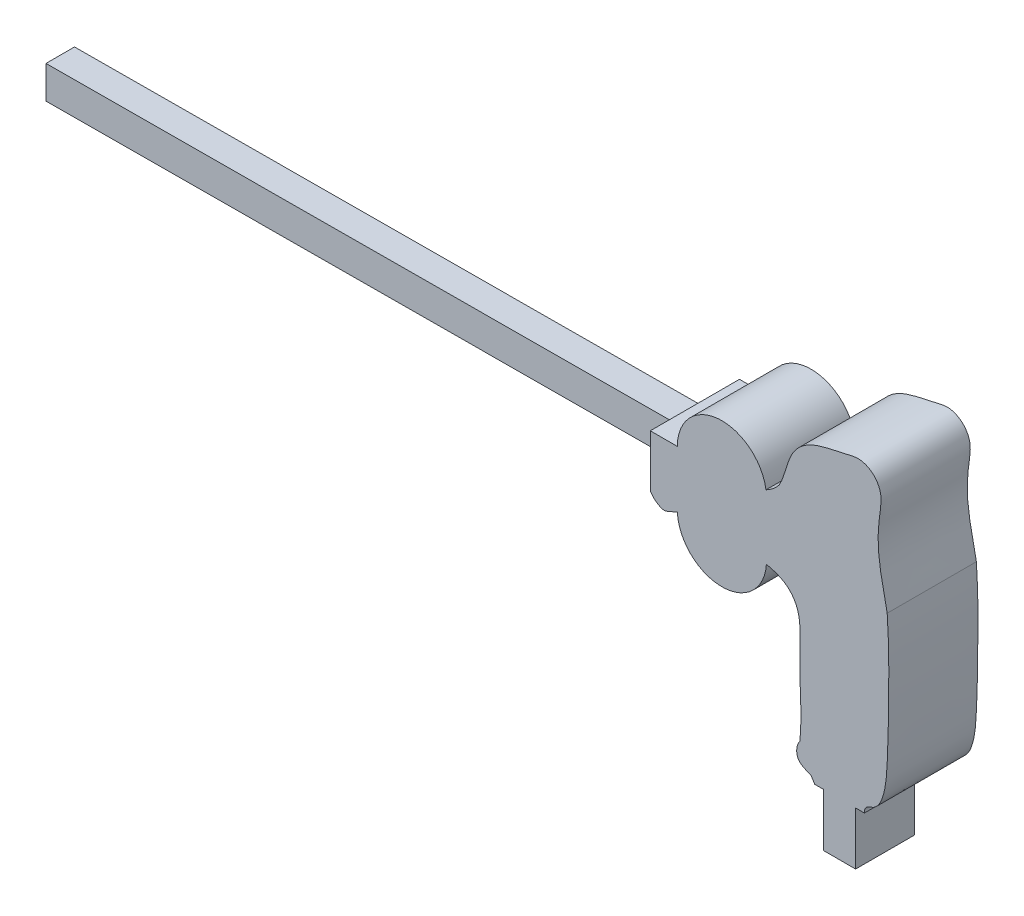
ISO-10303-21;
HEADER;
FILE_DESCRIPTION(('STEP AP214'),'2;1');
FILE_NAME('part.step','',(''),(''),'','','');
FILE_SCHEMA(('AUTOMOTIVE_DESIGN { 1 0 10303 214 1 1 1 1 }'));
ENDSEC;
DATA;
#1=APPLICATION_CONTEXT('core data for automotive mechanical design processes');
#2=APPLICATION_PROTOCOL_DEFINITION('international standard','automotive_design',2000,#1);
#3=PRODUCT_CONTEXT('',#1,'mechanical');
#4=PRODUCT('Part','Part','',(#3));
#5=PRODUCT_RELATED_PRODUCT_CATEGORY('part','',(#4));
#6=PRODUCT_DEFINITION_FORMATION('','',#4);
#7=PRODUCT_DEFINITION_CONTEXT('part definition',#1,'design');
#8=PRODUCT_DEFINITION('design','',#6,#7);
#9=PRODUCT_DEFINITION_SHAPE('','',#8);
#10=(LENGTH_UNIT() NAMED_UNIT(*) SI_UNIT(.MILLI.,.METRE.));
#11=(NAMED_UNIT(*) PLANE_ANGLE_UNIT() SI_UNIT($,.RADIAN.));
#12=(NAMED_UNIT(*) SI_UNIT($,.STERADIAN.) SOLID_ANGLE_UNIT());
#13=UNCERTAINTY_MEASURE_WITH_UNIT(LENGTH_MEASURE(1.E-05),#10,'distance_accuracy_value','');
#14=(GEOMETRIC_REPRESENTATION_CONTEXT(3) GLOBAL_UNCERTAINTY_ASSIGNED_CONTEXT((#13)) GLOBAL_UNIT_ASSIGNED_CONTEXT((#10,
#11,#12)) REPRESENTATION_CONTEXT('',''));
#15=CARTESIAN_POINT('',(0.,0.,0.));
#16=DIRECTION('',(0.,0.,1.));
#17=DIRECTION('',(1.,0.,0.));
#18=AXIS2_PLACEMENT_3D('',#15,#16,#17);
#19=CARTESIAN_POINT('',(237.78817876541,19.4771324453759,-12.5));
#20=DIRECTION('',(1.,0.,0.));
#21=DIRECTION('',(0.,0.,-1.));
#22=AXIS2_PLACEMENT_3D('',#19,#20,#21);
#23=PLANE('',#22);
#24=DIRECTION('',(0.,0.,1.));
#25=VECTOR('',#24,1.);
#26=CARTESIAN_POINT('',(237.78817876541,4.63098302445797,-12.5));
#27=LINE('',#26,#25);
#28=CARTESIAN_POINT('',(237.78817876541,4.63098302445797,-4.));
#29=VERTEX_POINT('',#28);
#30=CARTESIAN_POINT('',(237.78817876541,4.63098302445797,12.5));
#31=VERTEX_POINT('',#30);
#32=EDGE_CURVE('E372',#29,#31,#27,.T.);
#33=ORIENTED_EDGE('',*,*,#32,.F.);
#34=DIRECTION('',(0.,1.,0.));
#35=VECTOR('',#34,1.);
#36=CARTESIAN_POINT('',(237.78817876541,4.63098302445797,-4.));
#37=LINE('',#36,#35);
#38=CARTESIAN_POINT('',(237.78817876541,19.4771324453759,-4.));
#39=VERTEX_POINT('',#38);
#40=EDGE_CURVE('E542',#29,#39,#37,.T.);
#41=ORIENTED_EDGE('',*,*,#40,.T.);
#42=DIRECTION('',(0.,0.,1.));
#43=VECTOR('',#42,1.);
#44=CARTESIAN_POINT('',(237.78817876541,19.4771324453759,-12.5));
#45=LINE('',#44,#43);
#46=CARTESIAN_POINT('',(237.78817876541,19.4771324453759,12.5));
#47=VERTEX_POINT('',#46);
#48=EDGE_CURVE('E369',#39,#47,#45,.T.);
#49=ORIENTED_EDGE('',*,*,#48,.T.);
#50=DIRECTION('',(0.,1.,0.));
#51=VECTOR('',#50,1.);
#52=CARTESIAN_POINT('',(237.78817876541,19.4771324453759,12.5));
#53=LINE('',#52,#51);
#54=EDGE_CURVE('E495',#31,#47,#53,.T.);
#55=ORIENTED_EDGE('',*,*,#54,.F.);
#56=EDGE_LOOP('',(#33,#41,#49,#55));
#57=FACE_BOUND('',#56,.T.);
#58=ADVANCED_FACE('F39',(#57),#23,.T.);
#59=CARTESIAN_POINT('',(237.78817876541,4.63098302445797,-12.5));
#60=DIRECTION('',(0.,-1.,0.));
#61=DIRECTION('',(0.,0.,-1.));
#62=AXIS2_PLACEMENT_3D('',#59,#60,#61);
#63=PLANE('',#62);
#64=DIRECTION('',(0.,0.,1.));
#65=VECTOR('',#64,1.);
#66=CARTESIAN_POINT('',(228.725327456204,4.63098302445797,-12.5));
#67=LINE('',#66,#65);
#68=CARTESIAN_POINT('',(228.725327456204,4.63098302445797,-4.));
#69=VERTEX_POINT('',#68);
#70=CARTESIAN_POINT('',(228.725327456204,4.63098302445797,12.5));
#71=VERTEX_POINT('',#70);
#72=EDGE_CURVE('E375',#69,#71,#67,.T.);
#73=ORIENTED_EDGE('',*,*,#72,.F.);
#74=DIRECTION('',(1.,0.,0.));
#75=VECTOR('',#74,1.);
#76=CARTESIAN_POINT('',(237.78817876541,4.63098302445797,-4.));
#77=LINE('',#76,#75);
#78=EDGE_CURVE('E546',#69,#29,#77,.T.);
#79=ORIENTED_EDGE('',*,*,#78,.T.);
#80=ORIENTED_EDGE('',*,*,#32,.T.);
#81=DIRECTION('',(1.,0.,0.));
#82=VECTOR('',#81,1.);
#83=CARTESIAN_POINT('',(237.78817876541,4.63098302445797,12.5));
#84=LINE('',#83,#82);
#85=EDGE_CURVE('E491',#71,#31,#84,.T.);
#86=ORIENTED_EDGE('',*,*,#85,.F.);
#87=EDGE_LOOP('',(#73,#79,#80,#86));
#88=FACE_BOUND('',#87,.T.);
#89=ADVANCED_FACE('F284',(#88),#63,.T.);
#90=CARTESIAN_POINT('',(228.725327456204,4.63098302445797,-12.5));
#91=DIRECTION('',(-1.,0.,0.));
#92=DIRECTION('',(0.,0.,1.));
#93=AXIS2_PLACEMENT_3D('',#90,#91,#92);
#94=PLANE('',#93);
#95=DIRECTION('',(0.,0.,1.));
#96=VECTOR('',#95,1.);
#97=CARTESIAN_POINT('',(228.725327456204,19.4771324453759,-12.5));
#98=LINE('',#97,#96);
#99=CARTESIAN_POINT('',(228.725327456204,19.4771324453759,-4.));
#100=VERTEX_POINT('',#99);
#101=CARTESIAN_POINT('',(228.725327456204,19.4771324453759,12.5));
#102=VERTEX_POINT('',#101);
#103=EDGE_CURVE('E378',#100,#102,#98,.T.);
#104=ORIENTED_EDGE('',*,*,#103,.F.);
#105=DIRECTION('',(0.,-1.,0.));
#106=VECTOR('',#105,1.);
#107=CARTESIAN_POINT('',(228.725327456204,4.63098302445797,-4.));
#108=LINE('',#107,#106);
#109=EDGE_CURVE('E534',#100,#69,#108,.T.);
#110=ORIENTED_EDGE('',*,*,#109,.T.);
#111=ORIENTED_EDGE('',*,*,#72,.T.);
#112=DIRECTION('',(0.,-1.,0.));
#113=VECTOR('',#112,1.);
#114=CARTESIAN_POINT('',(228.725327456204,4.63098302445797,12.5));
#115=LINE('',#114,#113);
#116=EDGE_CURVE('E487',#102,#71,#115,.T.);
#117=ORIENTED_EDGE('',*,*,#116,.F.);
#118=EDGE_LOOP('',(#104,#110,#111,#117));
#119=FACE_BOUND('',#118,.T.);
#120=ADVANCED_FACE('F268',(#119),#94,.T.);
#121=CARTESIAN_POINT('',(2.33858757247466,69.0909336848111,-12.5));
#122=DIRECTION('',(0.0048527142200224,-0.99998822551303,0.));
#123=DIRECTION('',(0.99998822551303,0.0048527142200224,0.));
#124=AXIS2_PLACEMENT_3D('',#121,#122,#123);
#125=PLANE('',#124);
#126=DIRECTION('',(0.,0.,1.));
#127=VECTOR('',#126,1.);
#128=CARTESIAN_POINT('',(2.33858757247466,69.0909336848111,-12.5));
#129=LINE('',#128,#127);
#130=CARTESIAN_POINT('',(2.33858757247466,69.0909336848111,-4.));
#131=VERTEX_POINT('',#130);
#132=CARTESIAN_POINT('',(2.33858757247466,69.0909336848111,4.));
#133=VERTEX_POINT('',#132);
#134=EDGE_CURVE('E398',#131,#133,#129,.T.);
#135=ORIENTED_EDGE('',*,*,#134,.F.);
#136=DIRECTION('',(0.99998822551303,0.0048527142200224,0.));
#137=VECTOR('',#136,1.);
#138=CARTESIAN_POINT('',(2.33858757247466,69.0909336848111,-4.));
#139=LINE('',#138,#137);
#140=CARTESIAN_POINT('',(180.305389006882,69.9545658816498,-4.));
#141=VERTEX_POINT('',#140);
#142=EDGE_CURVE('E445',#131,#141,#139,.T.);
#143=ORIENTED_EDGE('',*,*,#142,.T.);
#144=DIRECTION('',(0.,0.,1.));
#145=VECTOR('',#144,1.);
#146=CARTESIAN_POINT('',(180.305389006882,69.9545658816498,-12.5));
#147=LINE('',#146,#145);
#148=CARTESIAN_POINT('',(180.305389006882,69.9545658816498,4.));
#149=VERTEX_POINT('',#148);
#150=EDGE_CURVE('E397',#141,#149,#147,.T.);
#151=ORIENTED_EDGE('',*,*,#150,.T.);
#152=DIRECTION('',(0.99998822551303,0.0048527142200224,0.));
#153=VECTOR('',#152,1.);
#154=CARTESIAN_POINT('',(2.33858757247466,69.0909336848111,4.));
#155=LINE('',#154,#153);
#156=EDGE_CURVE('E433',#133,#149,#155,.T.);
#157=ORIENTED_EDGE('',*,*,#156,.F.);
#158=EDGE_LOOP('',(#135,#143,#151,#157));
#159=FACE_BOUND('',#158,.T.);
#160=ADVANCED_FACE('F264',(#159),#125,.T.);
#161=CARTESIAN_POINT('',(2.33858757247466,78.2464505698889,-12.5));
#162=DIRECTION('',(-1.,0.,0.));
#163=DIRECTION('',(0.,0.,1.));
#164=AXIS2_PLACEMENT_3D('',#161,#162,#163);
#165=PLANE('',#164);
#166=DIRECTION('',(0.,0.,1.));
#167=VECTOR('',#166,1.);
#168=CARTESIAN_POINT('',(2.33858757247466,78.2464505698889,-12.5));
#169=LINE('',#168,#167);
#170=CARTESIAN_POINT('',(2.33858757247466,78.2464505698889,-4.));
#171=VERTEX_POINT('',#170);
#172=CARTESIAN_POINT('',(2.33858757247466,78.2464505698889,4.));
#173=VERTEX_POINT('',#172);
#174=EDGE_CURVE('E400',#171,#173,#169,.T.);
#175=ORIENTED_EDGE('',*,*,#174,.F.);
#176=DIRECTION('',(0.,-1.,0.));
#177=VECTOR('',#176,1.);
#178=CARTESIAN_POINT('',(2.33858757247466,78.2464505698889,-4.));
#179=LINE('',#178,#177);
#180=EDGE_CURVE('E551',#171,#131,#179,.T.);
#181=ORIENTED_EDGE('',*,*,#180,.T.);
#182=ORIENTED_EDGE('',*,*,#134,.T.);
#183=DIRECTION('',(0.,-1.,0.));
#184=VECTOR('',#183,1.);
#185=CARTESIAN_POINT('',(2.33858757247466,78.2464505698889,4.));
#186=LINE('',#185,#184);
#187=EDGE_CURVE('E444',#173,#133,#186,.T.);
#188=ORIENTED_EDGE('',*,*,#187,.F.);
#189=EDGE_LOOP('',(#175,#181,#182,#188));
#190=FACE_BOUND('',#189,.T.);
#191=ADVANCED_FACE('F267',(#190),#165,.T.);
#192=CARTESIAN_POINT('',(180.305389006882,79.1100827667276,-12.5));
#193=DIRECTION('',(-0.00485271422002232,0.99998822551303,0.));
#194=DIRECTION('',(-0.99998822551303,-0.00485271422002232,0.));
#195=AXIS2_PLACEMENT_3D('',#192,#193,#194);
#196=PLANE('',#195);
#197=DIRECTION('',(0.,0.,1.));
#198=VECTOR('',#197,1.);
#199=CARTESIAN_POINT('',(180.305389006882,79.1100827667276,-12.5));
#200=LINE('',#199,#198);
#201=CARTESIAN_POINT('',(180.305389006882,79.1100827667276,-4.));
#202=VERTEX_POINT('',#201);
#203=CARTESIAN_POINT('',(180.305389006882,79.1100827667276,4.));
#204=VERTEX_POINT('',#203);
#205=EDGE_CURVE('E359',#202,#204,#200,.T.);
#206=ORIENTED_EDGE('',*,*,#205,.F.);
#207=DIRECTION('',(-0.99998822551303,-0.00485271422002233,0.));
#208=VECTOR('',#207,1.);
#209=CARTESIAN_POINT('',(180.305389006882,79.1100827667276,-4.));
#210=LINE('',#209,#208);
#211=EDGE_CURVE('E555',#202,#171,#210,.T.);
#212=ORIENTED_EDGE('',*,*,#211,.T.);
#213=ORIENTED_EDGE('',*,*,#174,.T.);
#214=DIRECTION('',(-0.99998822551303,-0.00485271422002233,0.));
#215=VECTOR('',#214,1.);
#216=CARTESIAN_POINT('',(180.305389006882,79.1100827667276,4.));
#217=LINE('',#216,#215);
#218=EDGE_CURVE('E430',#204,#173,#217,.T.);
#219=ORIENTED_EDGE('',*,*,#218,.F.);
#220=EDGE_LOOP('',(#206,#212,#213,#219));
#221=FACE_BOUND('',#220,.T.);
#222=ADVANCED_FACE('F271',(#221),#196,.T.);
#223=CARTESIAN_POINT('',(210.826727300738,83.3447888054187,-12.5));
#224=DIRECTION('',(0.,0.,-1.));
#225=DIRECTION('',(-1.,0.,0.));
#226=AXIS2_PLACEMENT_3D('',#223,#224,#225);
#227=PLANE('',#226);
#228=DIRECTION('',(-1.,0.,0.));
#229=VECTOR('',#228,1.);
#230=CARTESIAN_POINT('',(180.233418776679,82.2569696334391,-12.5));
#231=LINE('',#230,#229);
#232=CARTESIAN_POINT('',(187.805389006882,82.2569696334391,-12.5));
#233=VERTEX_POINT('',#232);
#234=CARTESIAN_POINT('',(180.233418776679,82.2569696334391,-12.5));
#235=VERTEX_POINT('',#234);
#236=EDGE_CURVE('E354',#233,#235,#231,.T.);
#237=ORIENTED_EDGE('',*,*,#236,.F.);
#238=CARTESIAN_POINT('',(200.305389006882,82.2569696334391,-12.5));
#239=DIRECTION('',(0.,0.,-1.));
#240=DIRECTION('',(-1.,0.,0.));
#241=AXIS2_PLACEMENT_3D('',#238,#239,#240);
#242=CIRCLE('',#241,12.5);
#243=CARTESIAN_POINT('',(212.663398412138,84.1356935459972,-12.5));
#244=VERTEX_POINT('',#243);
#245=EDGE_CURVE('E206',#244,#233,#242,.F.);
#246=ORIENTED_EDGE('',*,*,#245,.F.);
#247=CARTESIAN_POINT('',(216.398749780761,87.183666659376,-12.5));
#248=CARTESIAN_POINT('',(213.460430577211,83.4489456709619,-12.5));
#249=CARTESIAN_POINT('',(208.578807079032,82.3236123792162,-12.5));
#250=CARTESIAN_POINT('',(204.097355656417,82.2569696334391,-12.5));
#251=B_SPLINE_CURVE_WITH_KNOTS('',3,(#247,#248,#249,#250),.UNSPECIFIED.,.F.,.F.,(4,4),(0.,1.),.UNSPECIFIED.);
#252=CARTESIAN_POINT('',(216.398749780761,87.183666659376,-12.5));
#253=VERTEX_POINT('',#252);
#254=EDGE_CURVE('E204',#253,#244,#251,.T.);
#255=ORIENTED_EDGE('',*,*,#254,.F.);
#256=CARTESIAN_POINT('',(246.644185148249,71.1770753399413,-12.5));
#257=CARTESIAN_POINT('',(245.727527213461,75.8904281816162,-12.5));
#258=CARTESIAN_POINT('',(243.982471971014,82.5914101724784,-12.5));
#259=CARTESIAN_POINT('',(244.083507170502,91.015197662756,-12.5));
#260=CARTESIAN_POINT('',(244.81893961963,95.5361811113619,-12.5));
#261=CARTESIAN_POINT('',(245.086282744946,99.2725188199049,-12.5));
#262=CARTESIAN_POINT('',(243.704467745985,102.223072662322,-12.5));
#263=CARTESIAN_POINT('',(241.283224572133,104.176054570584,-12.5));
#264=CARTESIAN_POINT('',(238.404865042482,104.875412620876,-12.5));
#265=CARTESIAN_POINT('',(234.862449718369,103.9182772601,-12.5));
#266=CARTESIAN_POINT('',(229.913614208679,102.993637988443,-12.5));
#267=CARTESIAN_POINT('',(224.401035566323,101.435637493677,-12.5));
#268=CARTESIAN_POINT('',(218.629506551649,96.0911920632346,-12.5));
#269=CARTESIAN_POINT('',(218.165596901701,90.4245521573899,-12.5));
#270=CARTESIAN_POINT('',(216.398749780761,87.183666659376,-12.5));
#271=B_SPLINE_CURVE_WITH_KNOTS('',3,(#256,#257,#258,#259,#260,#261,#262,#263,#264,#265,#266,
#267,#268,#269,#270),.UNSPECIFIED.,.F.,.F.,(4,1,1,1,1,1,1,1,1,1,1,1,4),(0.,0.212628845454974,
0.301900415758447,0.368563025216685,0.415379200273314,0.464251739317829,0.50509853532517,
0.549312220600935,0.588617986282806,0.664651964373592,0.773290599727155,0.834456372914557,1.),.UNSPECIFIED.);
#272=CARTESIAN_POINT('',(246.644185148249,71.1770753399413,-12.5));
#273=VERTEX_POINT('',#272);
#274=EDGE_CURVE('E330',#273,#253,#271,.T.);
#275=ORIENTED_EDGE('',*,*,#274,.F.);
#276=CARTESIAN_POINT('',(240.25665966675,19.4771324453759,-12.5));
#277=CARTESIAN_POINT('',(240.098041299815,20.3245157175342,-12.5));
#278=CARTESIAN_POINT('',(240.926921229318,21.5668450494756,-12.5));
#279=CARTESIAN_POINT('',(242.917121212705,21.9813740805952,-12.5));
#280=CARTESIAN_POINT('',(244.541512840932,23.6633817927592,-12.5));
#281=CARTESIAN_POINT('',(246.239670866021,27.9414798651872,-12.5));
#282=CARTESIAN_POINT('',(246.842250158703,36.9145344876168,-12.5));
#283=CARTESIAN_POINT('',(247.094622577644,51.8606007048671,-12.5));
#284=CARTESIAN_POINT('',(247.180317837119,64.0448293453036,-12.5));
#285=CARTESIAN_POINT('',(246.644185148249,71.1770753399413,-12.5));
#286=B_SPLINE_CURVE_WITH_KNOTS('',3,(#276,#277,#278,#279,#280,#281,#282,#283,#284,#285),
.UNSPECIFIED.,.F.,.F.,(4,1,1,1,1,1,1,4),(0.,0.0426466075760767,0.0724649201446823,
0.109027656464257,0.166527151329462,0.325212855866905,0.602803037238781,1.),.UNSPECIFIED.);
#287=CARTESIAN_POINT('',(240.25665966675,19.4771324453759,-12.5));
#288=VERTEX_POINT('',#287);
#289=EDGE_CURVE('E323',#288,#273,#286,.T.);
#290=ORIENTED_EDGE('',*,*,#289,.F.);
#291=DIRECTION('',(1.,0.,0.));
#292=VECTOR('',#291,1.);
#293=CARTESIAN_POINT('',(228.725327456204,19.4771324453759,-12.5));
#294=LINE('',#293,#292);
#295=CARTESIAN_POINT('',(226.334854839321,19.4771324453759,-12.5));
#296=VERTEX_POINT('',#295);
#297=EDGE_CURVE('E320',#296,#288,#294,.T.);
#298=ORIENTED_EDGE('',*,*,#297,.F.);
#299=DIRECTION('',(0.533028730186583,-0.846097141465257,0.));
#300=VECTOR('',#299,1.);
#301=CARTESIAN_POINT('',(226.334854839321,19.4771324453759,-12.5));
#302=LINE('',#301,#300);
#303=CARTESIAN_POINT('',(225.324340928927,21.0811603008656,-12.5));
#304=VERTEX_POINT('',#303);
#305=EDGE_CURVE('E313',#304,#296,#302,.T.);
#306=ORIENTED_EDGE('',*,*,#305,.F.);
#307=CARTESIAN_POINT('',(222.152115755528,27.8279715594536,-12.5));
#308=CARTESIAN_POINT('',(221.226759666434,26.6781308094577,-12.5));
#309=CARTESIAN_POINT('',(220.62572581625,22.5804737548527,-12.5));
#310=CARTESIAN_POINT('',(224.264133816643,21.6154282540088,-12.5));
#311=CARTESIAN_POINT('',(225.324340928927,21.0811603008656,-12.5));
#312=B_SPLINE_CURVE_WITH_KNOTS('',3,(#307,#308,#309,#310,#311),.UNSPECIFIED.,.F.,.F.,(4,1,4),
(0.,0.544916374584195,1.),.UNSPECIFIED.);
#313=CARTESIAN_POINT('',(222.152115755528,27.8279715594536,-12.5));
#314=VERTEX_POINT('',#313);
#315=EDGE_CURVE('E306',#314,#304,#312,.T.);
#316=ORIENTED_EDGE('',*,*,#315,.F.);
#317=CARTESIAN_POINT('',(189.551646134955,66.7979158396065,-12.5));
#318=CARTESIAN_POINT('',(191.261165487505,66.9502664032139,-12.5));
#319=CARTESIAN_POINT('',(196.885705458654,66.7958279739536,-12.5));
#320=CARTESIAN_POINT('',(205.122737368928,67.1075045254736,-12.5));
#321=CARTESIAN_POINT('',(213.396994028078,66.37060065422,-12.5));
#322=CARTESIAN_POINT('',(218.888017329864,64.0474200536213,-12.5));
#323=CARTESIAN_POINT('',(221.55831740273,60.1984599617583,-12.5));
#324=CARTESIAN_POINT('',(222.454796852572,55.0595636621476,-12.5));
#325=CARTESIAN_POINT('',(221.984082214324,48.0872232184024,-12.5));
#326=CARTESIAN_POINT('',(222.389816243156,38.6572637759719,-12.5));
#327=CARTESIAN_POINT('',(222.558851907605,31.6313517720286,-12.5));
#328=CARTESIAN_POINT('',(222.152115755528,27.8279715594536,-12.5));
#329=B_SPLINE_CURVE_WITH_KNOTS('',3,(#317,#318,#319,#320,#321,#322,#323,#324,#325,#326,#327,
#328),.UNSPECIFIED.,.F.,.F.,(4,1,1,1,1,1,1,1,1,4),(0.,0.077358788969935,0.25375899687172,
0.371848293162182,0.451062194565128,0.5130702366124,0.574104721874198,0.683082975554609,
0.827755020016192,1.),.UNSPECIFIED.);
#330=CARTESIAN_POINT('',(212.781934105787,66.1523385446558,-12.5));
#331=VERTEX_POINT('',#330);
#332=EDGE_CURVE('E244',#331,#314,#329,.T.);
#333=ORIENTED_EDGE('',*,*,#332,.F.);
#334=CARTESIAN_POINT('',(200.305389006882,66.9177288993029,-12.5));
#335=DIRECTION('',(0.,0.,-1.));
#336=DIRECTION('',(-1.,0.,0.));
#337=AXIS2_PLACEMENT_3D('',#334,#335,#336);
#338=CIRCLE('',#337,12.5);
#339=CARTESIAN_POINT('',(187.821930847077,66.2748662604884,-12.5));
#340=VERTEX_POINT('',#339);
#341=EDGE_CURVE('E525',#340,#331,#338,.F.);
#342=ORIENTED_EDGE('',*,*,#341,.F.);
#343=CARTESIAN_POINT('',(180.361785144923,67.4886537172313,-12.5));
#344=CARTESIAN_POINT('',(180.942851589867,66.5603262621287,-12.5));
#345=CARTESIAN_POINT('',(182.103072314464,65.4941175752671,-12.5));
#346=CARTESIAN_POINT('',(184.118081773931,64.7218880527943,-12.5));
#347=CARTESIAN_POINT('',(186.437869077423,65.6795379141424,-12.5));
#348=CARTESIAN_POINT('',(188.085305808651,66.4776104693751,-12.5));
#349=CARTESIAN_POINT('',(189.551646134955,66.7979158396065,-12.5));
#350=B_SPLINE_CURVE_WITH_KNOTS('',3,(#343,#344,#345,#346,#347,#348,#349),.UNSPECIFIED.,.F.,.F.,
(4,1,1,1,4),(0.,0.304527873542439,0.459893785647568,0.576194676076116,1.),.UNSPECIFIED.);
#351=CARTESIAN_POINT('',(180.361785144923,67.4886537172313,-12.5));
#352=VERTEX_POINT('',#351);
#353=EDGE_CURVE('E238',#352,#340,#350,.T.);
#354=ORIENTED_EDGE('',*,*,#353,.F.);
#355=DIRECTION('',(0.0228643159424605,-0.999738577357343,0.));
#356=VECTOR('',#355,1.);
#357=CARTESIAN_POINT('',(180.305389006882,69.9545658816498,-12.5));
#358=LINE('',#357,#356);
#359=CARTESIAN_POINT('',(180.305389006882,69.9545658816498,-12.5));
#360=VERTEX_POINT('',#359);
#361=EDGE_CURVE('E234',#360,#352,#358,.T.);
#362=ORIENTED_EDGE('',*,*,#361,.F.);
#363=DIRECTION('',(0.,1.,0.));
#364=VECTOR('',#363,1.);
#365=CARTESIAN_POINT('',(180.305389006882,79.1100827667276,-12.5));
#366=LINE('',#365,#364);
#367=CARTESIAN_POINT('',(180.305389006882,79.1100827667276,-12.5));
#368=VERTEX_POINT('',#367);
#369=EDGE_CURVE('E550',#360,#368,#366,.T.);
#370=ORIENTED_EDGE('',*,*,#369,.T.);
#371=DIRECTION('',(0.0228643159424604,-0.999738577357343,0.));
#372=VECTOR('',#371,1.);
#373=CARTESIAN_POINT('',(180.305389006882,79.1100827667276,-12.5));
#374=LINE('',#373,#372);
#375=EDGE_CURVE('E218',#235,#368,#374,.T.);
#376=ORIENTED_EDGE('',*,*,#375,.F.);
#377=EDGE_LOOP('',(#237,#246,#255,#275,#290,#298,#306,#316,#333,#342,#354,#362,#370,#376));
#378=FACE_BOUND('',#377,.T.);
#379=ADVANCED_FACE('F274',(#378),#227,.T.);
#380=CARTESIAN_POINT('',(180.305389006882,79.1100827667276,-12.5));
#381=DIRECTION('',(-0.999738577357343,-0.0228643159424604,0.));
#382=DIRECTION('',(0.0228643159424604,-0.999738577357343,0.));
#383=AXIS2_PLACEMENT_3D('',#380,#381,#382);
#384=PLANE('',#383);
#385=EDGE_CURVE('E43',#368,#202,#200,.T.);
#386=ORIENTED_EDGE('',*,*,#385,.T.);
#387=ORIENTED_EDGE('',*,*,#205,.T.);
#388=DIRECTION('',(0.,0.,1.));
#389=VECTOR('',#388,1.);
#390=CARTESIAN_POINT('',(180.305389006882,79.1100827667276,4.));
#391=LINE('',#390,#389);
#392=CARTESIAN_POINT('',(180.305389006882,79.1100827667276,12.5));
#393=VERTEX_POINT('',#392);
#394=EDGE_CURVE('E413',#204,#393,#391,.T.);
#395=ORIENTED_EDGE('',*,*,#394,.T.);
#396=DIRECTION('',(0.0228643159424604,-0.999738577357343,0.));
#397=VECTOR('',#396,1.);
#398=CARTESIAN_POINT('',(180.305389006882,79.1100827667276,12.5));
#399=LINE('',#398,#397);
#400=CARTESIAN_POINT('',(180.233418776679,82.2569696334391,12.5));
#401=VERTEX_POINT('',#400);
#402=EDGE_CURVE('E424',#401,#393,#399,.T.);
#403=ORIENTED_EDGE('',*,*,#402,.F.);
#404=DIRECTION('',(0.,0.,1.));
#405=VECTOR('',#404,1.);
#406=CARTESIAN_POINT('',(180.233418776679,82.2569696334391,-12.5));
#407=LINE('',#406,#405);
#408=EDGE_CURVE('E11',#235,#401,#407,.T.);
#409=ORIENTED_EDGE('',*,*,#408,.F.);
#410=ORIENTED_EDGE('',*,*,#375,.T.);
#411=EDGE_LOOP('',(#386,#387,#395,#403,#409,#410));
#412=FACE_BOUND('',#411,.T.);
#413=ADVANCED_FACE('F41',(#412),#384,.T.);
#414=CARTESIAN_POINT('',(180.233418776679,82.2569696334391,-12.5));
#415=DIRECTION('',(0.,1.,0.));
#416=DIRECTION('',(0.,0.,1.));
#417=AXIS2_PLACEMENT_3D('',#414,#415,#416);
#418=PLANE('',#417);
#419=DIRECTION('',(0.,0.,1.));
#420=VECTOR('',#419,1.);
#421=CARTESIAN_POINT('',(187.805389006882,82.2569696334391,-40.4923518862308));
#422=LINE('',#421,#420);
#423=CARTESIAN_POINT('',(187.805389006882,82.2569696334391,12.5));
#424=VERTEX_POINT('',#423);
#425=EDGE_CURVE('E195',#233,#424,#422,.T.);
#426=ORIENTED_EDGE('',*,*,#425,.F.);
#427=ORIENTED_EDGE('',*,*,#236,.T.);
#428=ORIENTED_EDGE('',*,*,#408,.T.);
#429=DIRECTION('',(-1.,0.,0.));
#430=VECTOR('',#429,1.);
#431=CARTESIAN_POINT('',(180.233418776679,82.2569696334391,12.5));
#432=LINE('',#431,#430);
#433=EDGE_CURVE('E214',#424,#401,#432,.T.);
#434=ORIENTED_EDGE('',*,*,#433,.F.);
#435=EDGE_LOOP('',(#426,#427,#428,#434));
#436=FACE_BOUND('',#435,.T.);
#437=ADVANCED_FACE('F348',(#436),#418,.T.);
#438=DIRECTION('',(0.,0.,1.));
#439=VECTOR('',#438,1.);
#440=SURFACE_OF_LINEAR_EXTRUSION('',#251,#439);
#441=DIRECTION('',(0.,0.,1.));
#442=VECTOR('',#441,1.);
#443=CARTESIAN_POINT('',(212.663398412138,84.1356935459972,-40.4923518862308));
#444=LINE('',#443,#442);
#445=CARTESIAN_POINT('',(212.663398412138,84.1356935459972,12.5));
#446=VERTEX_POINT('',#445);
#447=EDGE_CURVE('E192',#244,#446,#444,.T.);
#448=ORIENTED_EDGE('',*,*,#447,.T.);
#449=CARTESIAN_POINT('',(216.398749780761,87.183666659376,12.5));
#450=CARTESIAN_POINT('',(213.460430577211,83.4489456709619,12.5));
#451=CARTESIAN_POINT('',(208.578807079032,82.3236123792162,12.5));
#452=CARTESIAN_POINT('',(204.097355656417,82.2569696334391,12.5));
#453=B_SPLINE_CURVE_WITH_KNOTS('',3,(#449,#450,#451,#452),.UNSPECIFIED.,.F.,.F.,(4,4),(0.,1.),.UNSPECIFIED.);
#454=CARTESIAN_POINT('',(216.398749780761,87.183666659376,12.5));
#455=VERTEX_POINT('',#454);
#456=EDGE_CURVE('E202',#455,#446,#453,.T.);
#457=ORIENTED_EDGE('',*,*,#456,.F.);
#458=DIRECTION('',(0.,0.,1.));
#459=VECTOR('',#458,1.);
#460=CARTESIAN_POINT('',(216.398749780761,87.183666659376,-12.5));
#461=LINE('',#460,#459);
#462=EDGE_CURVE('E49',#253,#455,#461,.T.);
#463=ORIENTED_EDGE('',*,*,#462,.F.);
#464=ORIENTED_EDGE('',*,*,#254,.T.);
#465=EDGE_LOOP('',(#448,#457,#463,#464));
#466=FACE_BOUND('',#465,.T.);
#467=ADVANCED_FACE('F201',(#466),#440,.T.);
#468=DIRECTION('',(0.,0.,1.));
#469=VECTOR('',#468,1.);
#470=SURFACE_OF_LINEAR_EXTRUSION('',#271,#469);
#471=ORIENTED_EDGE('',*,*,#462,.T.);
#472=CARTESIAN_POINT('',(246.644185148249,71.1770753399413,12.5));
#473=CARTESIAN_POINT('',(245.727527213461,75.8904281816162,12.5));
#474=CARTESIAN_POINT('',(243.982471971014,82.5914101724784,12.5));
#475=CARTESIAN_POINT('',(244.083507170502,91.015197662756,12.5));
#476=CARTESIAN_POINT('',(244.81893961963,95.5361811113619,12.5));
#477=CARTESIAN_POINT('',(245.086282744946,99.2725188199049,12.5));
#478=CARTESIAN_POINT('',(243.704467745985,102.223072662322,12.5));
#479=CARTESIAN_POINT('',(241.283224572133,104.176054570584,12.5));
#480=CARTESIAN_POINT('',(238.404865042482,104.875412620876,12.5));
#481=CARTESIAN_POINT('',(234.862449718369,103.9182772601,12.5));
#482=CARTESIAN_POINT('',(229.913614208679,102.993637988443,12.5));
#483=CARTESIAN_POINT('',(224.401035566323,101.435637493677,12.5));
#484=CARTESIAN_POINT('',(218.629506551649,96.0911920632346,12.5));
#485=CARTESIAN_POINT('',(218.165596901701,90.4245521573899,12.5));
#486=CARTESIAN_POINT('',(216.398749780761,87.183666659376,12.5));
#487=B_SPLINE_CURVE_WITH_KNOTS('',3,(#472,#473,#474,#475,#476,#477,#478,#479,#480,#481,#482,
#483,#484,#485,#486),.UNSPECIFIED.,.F.,.F.,(4,1,1,1,1,1,1,1,1,1,1,1,4),(0.,0.212628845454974,
0.301900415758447,0.368563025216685,0.415379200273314,0.464251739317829,0.50509853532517,
0.549312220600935,0.588617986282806,0.664651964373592,0.773290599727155,0.834456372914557,1.),.UNSPECIFIED.);
#488=CARTESIAN_POINT('',(246.644185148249,71.1770753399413,12.5));
#489=VERTEX_POINT('',#488);
#490=EDGE_CURVE('E212',#489,#455,#487,.T.);
#491=ORIENTED_EDGE('',*,*,#490,.F.);
#492=DIRECTION('',(0.,0.,1.));
#493=VECTOR('',#492,1.);
#494=CARTESIAN_POINT('',(246.644185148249,71.1770753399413,-12.5));
#495=LINE('',#494,#493);
#496=EDGE_CURVE('E363',#273,#489,#495,.T.);
#497=ORIENTED_EDGE('',*,*,#496,.F.);
#498=ORIENTED_EDGE('',*,*,#274,.T.);
#499=EDGE_LOOP('',(#471,#491,#497,#498));
#500=FACE_BOUND('',#499,.T.);
#501=ADVANCED_FACE('F341',(#500),#470,.T.);
#502=DIRECTION('',(0.,0.,1.));
#503=VECTOR('',#502,1.);
#504=SURFACE_OF_LINEAR_EXTRUSION('',#286,#503);
#505=ORIENTED_EDGE('',*,*,#496,.T.);
#506=CARTESIAN_POINT('',(240.25665966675,19.4771324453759,12.5));
#507=CARTESIAN_POINT('',(240.098041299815,20.3245157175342,12.5));
#508=CARTESIAN_POINT('',(240.926921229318,21.5668450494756,12.5));
#509=CARTESIAN_POINT('',(242.917121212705,21.9813740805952,12.5));
#510=CARTESIAN_POINT('',(244.541512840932,23.6633817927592,12.5));
#511=CARTESIAN_POINT('',(246.239670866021,27.9414798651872,12.5));
#512=CARTESIAN_POINT('',(246.842250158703,36.9145344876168,12.5));
#513=CARTESIAN_POINT('',(247.094622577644,51.8606007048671,12.5));
#514=CARTESIAN_POINT('',(247.180317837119,64.0448293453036,12.5));
#515=CARTESIAN_POINT('',(246.644185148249,71.1770753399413,12.5));
#516=B_SPLINE_CURVE_WITH_KNOTS('',3,(#506,#507,#508,#509,#510,#511,#512,#513,#514,#515),
.UNSPECIFIED.,.F.,.F.,(4,1,1,1,1,1,1,4),(0.,0.0426466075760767,0.0724649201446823,
0.109027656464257,0.166527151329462,0.325212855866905,0.602803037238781,1.),.UNSPECIFIED.);
#517=CARTESIAN_POINT('',(240.25665966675,19.4771324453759,12.5));
#518=VERTEX_POINT('',#517);
#519=EDGE_CURVE('E220',#518,#489,#516,.T.);
#520=ORIENTED_EDGE('',*,*,#519,.F.);
#521=DIRECTION('',(0.,0.,1.));
#522=VECTOR('',#521,1.);
#523=CARTESIAN_POINT('',(240.25665966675,19.4771324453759,-12.5));
#524=LINE('',#523,#522);
#525=EDGE_CURVE('E366',#288,#518,#524,.T.);
#526=ORIENTED_EDGE('',*,*,#525,.F.);
#527=ORIENTED_EDGE('',*,*,#289,.T.);
#528=EDGE_LOOP('',(#505,#520,#526,#527));
#529=FACE_BOUND('',#528,.T.);
#530=ADVANCED_FACE('F338',(#529),#504,.T.);
#531=CARTESIAN_POINT('',(240.25665966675,19.4771324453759,-12.5));
#532=DIRECTION('',(0.,-1.,0.));
#533=DIRECTION('',(0.,0.,-1.));
#534=AXIS2_PLACEMENT_3D('',#531,#532,#533);
#535=PLANE('',#534);
#536=ORIENTED_EDGE('',*,*,#525,.T.);
#537=DIRECTION('',(1.,0.,0.));
#538=VECTOR('',#537,1.);
#539=CARTESIAN_POINT('',(240.25665966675,19.4771324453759,12.5));
#540=LINE('',#539,#538);
#541=EDGE_CURVE('E499',#47,#518,#540,.T.);
#542=ORIENTED_EDGE('',*,*,#541,.F.);
#543=ORIENTED_EDGE('',*,*,#48,.F.);
#544=DIRECTION('',(-1.,0.,0.));
#545=VECTOR('',#544,1.);
#546=CARTESIAN_POINT('',(237.78817876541,19.4771324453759,-4.));
#547=LINE('',#546,#545);
#548=EDGE_CURVE('E538',#39,#100,#547,.T.);
#549=ORIENTED_EDGE('',*,*,#548,.T.);
#550=ORIENTED_EDGE('',*,*,#103,.T.);
#551=DIRECTION('',(1.,0.,0.));
#552=VECTOR('',#551,1.);
#553=CARTESIAN_POINT('',(228.725327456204,19.4771324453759,12.5));
#554=LINE('',#553,#552);
#555=CARTESIAN_POINT('',(226.334854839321,19.4771324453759,12.5));
#556=VERTEX_POINT('',#555);
#557=EDGE_CURVE('E483',#556,#102,#554,.T.);
#558=ORIENTED_EDGE('',*,*,#557,.F.);
#559=DIRECTION('',(0.,0.,1.));
#560=VECTOR('',#559,1.);
#561=CARTESIAN_POINT('',(226.334854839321,19.4771324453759,-12.5));
#562=LINE('',#561,#560);
#563=EDGE_CURVE('E381',#296,#556,#562,.T.);
#564=ORIENTED_EDGE('',*,*,#563,.F.);
#565=ORIENTED_EDGE('',*,*,#297,.T.);
#566=EDGE_LOOP('',(#536,#542,#543,#549,#550,#558,#564,#565));
#567=FACE_BOUND('',#566,.T.);
#568=ADVANCED_FACE('F294',(#567),#535,.T.);
#569=CARTESIAN_POINT('',(226.334854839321,19.4771324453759,-12.5));
#570=DIRECTION('',(-0.846097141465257,-0.533028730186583,0.));
#571=DIRECTION('',(0.533028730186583,-0.846097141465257,0.));
#572=AXIS2_PLACEMENT_3D('',#569,#570,#571);
#573=PLANE('',#572);
#574=ORIENTED_EDGE('',*,*,#563,.T.);
#575=DIRECTION('',(0.533028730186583,-0.846097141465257,0.));
#576=VECTOR('',#575,1.);
#577=CARTESIAN_POINT('',(226.334854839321,19.4771324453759,12.5));
#578=LINE('',#577,#576);
#579=CARTESIAN_POINT('',(225.324340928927,21.0811603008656,12.5));
#580=VERTEX_POINT('',#579);
#581=EDGE_CURVE('E476',#580,#556,#578,.T.);
#582=ORIENTED_EDGE('',*,*,#581,.F.);
#583=DIRECTION('',(0.,0.,1.));
#584=VECTOR('',#583,1.);
#585=CARTESIAN_POINT('',(225.324340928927,21.0811603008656,-12.5));
#586=LINE('',#585,#584);
#587=EDGE_CURVE('E384',#304,#580,#586,.T.);
#588=ORIENTED_EDGE('',*,*,#587,.F.);
#589=ORIENTED_EDGE('',*,*,#305,.T.);
#590=EDGE_LOOP('',(#574,#582,#588,#589));
#591=FACE_BOUND('',#590,.T.);
#592=ADVANCED_FACE('F300',(#591),#573,.T.);
#593=DIRECTION('',(0.,0.,1.));
#594=VECTOR('',#593,1.);
#595=SURFACE_OF_LINEAR_EXTRUSION('',#312,#594);
#596=ORIENTED_EDGE('',*,*,#587,.T.);
#597=CARTESIAN_POINT('',(222.152115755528,27.8279715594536,12.5));
#598=CARTESIAN_POINT('',(221.226759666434,26.6781308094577,12.5));
#599=CARTESIAN_POINT('',(220.62572581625,22.5804737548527,12.5));
#600=CARTESIAN_POINT('',(224.264133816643,21.6154282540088,12.5));
#601=CARTESIAN_POINT('',(225.324340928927,21.0811603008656,12.5));
#602=B_SPLINE_CURVE_WITH_KNOTS('',3,(#597,#598,#599,#600,#601),.UNSPECIFIED.,.F.,.F.,(4,1,4),
(0.,0.544916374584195,1.),.UNSPECIFIED.);
#603=CARTESIAN_POINT('',(222.152115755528,27.8279715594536,12.5));
#604=VERTEX_POINT('',#603);
#605=EDGE_CURVE('E467',#604,#580,#602,.T.);
#606=ORIENTED_EDGE('',*,*,#605,.F.);
#607=DIRECTION('',(0.,0.,1.));
#608=VECTOR('',#607,1.);
#609=CARTESIAN_POINT('',(222.152115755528,27.8279715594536,-12.5));
#610=LINE('',#609,#608);
#611=EDGE_CURVE('E387',#314,#604,#610,.T.);
#612=ORIENTED_EDGE('',*,*,#611,.F.);
#613=ORIENTED_EDGE('',*,*,#315,.T.);
#614=EDGE_LOOP('',(#596,#606,#612,#613));
#615=FACE_BOUND('',#614,.T.);
#616=ADVANCED_FACE('F302',(#615),#595,.T.);
#617=DIRECTION('',(0.,0.,1.));
#618=VECTOR('',#617,1.);
#619=SURFACE_OF_LINEAR_EXTRUSION('',#329,#618);
#620=DIRECTION('',(0.,0.,1.));
#621=VECTOR('',#620,1.);
#622=CARTESIAN_POINT('',(212.781934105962,66.1523385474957,-40.4923518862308));
#623=LINE('',#622,#621);
#624=CARTESIAN_POINT('',(212.781934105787,66.1523385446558,12.5));
#625=VERTEX_POINT('',#624);
#626=EDGE_CURVE('E65',#331,#625,#623,.T.);
#627=ORIENTED_EDGE('',*,*,#626,.F.);
#628=ORIENTED_EDGE('',*,*,#332,.T.);
#629=ORIENTED_EDGE('',*,*,#611,.T.);
#630=CARTESIAN_POINT('',(189.551646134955,66.7979158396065,12.5));
#631=CARTESIAN_POINT('',(191.261165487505,66.9502664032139,12.5));
#632=CARTESIAN_POINT('',(196.885705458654,66.7958279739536,12.5));
#633=CARTESIAN_POINT('',(205.122737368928,67.1075045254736,12.5));
#634=CARTESIAN_POINT('',(213.396994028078,66.37060065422,12.5));
#635=CARTESIAN_POINT('',(218.888017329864,64.0474200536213,12.5));
#636=CARTESIAN_POINT('',(221.55831740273,60.1984599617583,12.5));
#637=CARTESIAN_POINT('',(222.454796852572,55.0595636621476,12.5));
#638=CARTESIAN_POINT('',(221.984082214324,48.0872232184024,12.5));
#639=CARTESIAN_POINT('',(222.389816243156,38.6572637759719,12.5));
#640=CARTESIAN_POINT('',(222.558851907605,31.6313517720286,12.5));
#641=CARTESIAN_POINT('',(222.152115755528,27.8279715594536,12.5));
#642=B_SPLINE_CURVE_WITH_KNOTS('',3,(#630,#631,#632,#633,#634,#635,#636,#637,#638,#639,#640,
#641),.UNSPECIFIED.,.F.,.F.,(4,1,1,1,1,1,1,1,1,4),(0.,0.077358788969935,0.25375899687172,
0.371848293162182,0.451062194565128,0.5130702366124,0.574104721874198,0.683082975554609,
0.827755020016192,1.),.UNSPECIFIED.);
#643=EDGE_CURVE('E459',#625,#604,#642,.T.);
#644=ORIENTED_EDGE('',*,*,#643,.F.);
#645=EDGE_LOOP('',(#627,#628,#629,#644));
#646=FACE_BOUND('',#645,.T.);
#647=ADVANCED_FACE('F258',(#646),#619,.T.);
#648=DIRECTION('',(0.,0.,1.));
#649=VECTOR('',#648,1.);
#650=SURFACE_OF_LINEAR_EXTRUSION('',#350,#649);
#651=DIRECTION('',(0.,0.,1.));
#652=VECTOR('',#651,1.);
#653=CARTESIAN_POINT('',(187.821930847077,66.2748662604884,-40.4923518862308));
#654=LINE('',#653,#652);
#655=CARTESIAN_POINT('',(187.821930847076,66.274866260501,12.5));
#656=VERTEX_POINT('',#655);
#657=EDGE_CURVE('E531',#340,#656,#654,.T.);
#658=ORIENTED_EDGE('',*,*,#657,.T.);
#659=CARTESIAN_POINT('',(180.361785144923,67.4886537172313,12.5));
#660=CARTESIAN_POINT('',(180.942851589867,66.5603262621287,12.5));
#661=CARTESIAN_POINT('',(182.103072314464,65.4941175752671,12.5));
#662=CARTESIAN_POINT('',(184.118081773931,64.7218880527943,12.5));
#663=CARTESIAN_POINT('',(186.437869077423,65.6795379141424,12.5));
#664=CARTESIAN_POINT('',(188.085305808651,66.4776104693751,12.5));
#665=CARTESIAN_POINT('',(189.551646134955,66.7979158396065,12.5));
#666=B_SPLINE_CURVE_WITH_KNOTS('',3,(#659,#660,#661,#662,#663,#664,#665),.UNSPECIFIED.,.F.,.F.,
(4,1,1,1,4),(0.,0.304527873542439,0.459893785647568,0.576194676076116,1.),.UNSPECIFIED.);
#667=CARTESIAN_POINT('',(180.361785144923,67.4886537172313,12.5));
#668=VERTEX_POINT('',#667);
#669=EDGE_CURVE('E453',#668,#656,#666,.T.);
#670=ORIENTED_EDGE('',*,*,#669,.F.);
#671=DIRECTION('',(0.,0.,1.));
#672=VECTOR('',#671,1.);
#673=CARTESIAN_POINT('',(180.361785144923,67.4886537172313,-12.5));
#674=LINE('',#673,#672);
#675=EDGE_CURVE('E391',#352,#668,#674,.T.);
#676=ORIENTED_EDGE('',*,*,#675,.F.);
#677=ORIENTED_EDGE('',*,*,#353,.T.);
#678=EDGE_LOOP('',(#658,#670,#676,#677));
#679=FACE_BOUND('',#678,.T.);
#680=ADVANCED_FACE('F253',(#679),#650,.T.);
#681=CARTESIAN_POINT('',(180.305389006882,69.9545658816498,-12.5));
#682=DIRECTION('',(-0.999738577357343,-0.0228643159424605,0.));
#683=DIRECTION('',(0.0228643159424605,-0.999738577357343,0.));
#684=AXIS2_PLACEMENT_3D('',#681,#682,#683);
#685=PLANE('',#684);
#686=ORIENTED_EDGE('',*,*,#675,.T.);
#687=DIRECTION('',(0.0228643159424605,-0.999738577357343,0.));
#688=VECTOR('',#687,1.);
#689=CARTESIAN_POINT('',(180.305389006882,69.9545658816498,12.5));
#690=LINE('',#689,#688);
#691=CARTESIAN_POINT('',(180.305389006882,69.9545658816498,12.5));
#692=VERTEX_POINT('',#691);
#693=EDGE_CURVE('E449',#692,#668,#690,.T.);
#694=ORIENTED_EDGE('',*,*,#693,.F.);
#695=DIRECTION('',(0.,0.,1.));
#696=VECTOR('',#695,1.);
#697=CARTESIAN_POINT('',(180.305389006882,69.9545658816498,4.));
#698=LINE('',#697,#696);
#699=EDGE_CURVE('E425',#149,#692,#698,.T.);
#700=ORIENTED_EDGE('',*,*,#699,.F.);
#701=ORIENTED_EDGE('',*,*,#150,.F.);
#702=EDGE_CURVE('E394',#360,#141,#147,.T.);
#703=ORIENTED_EDGE('',*,*,#702,.F.);
#704=ORIENTED_EDGE('',*,*,#361,.T.);
#705=EDGE_LOOP('',(#686,#694,#700,#701,#703,#704));
#706=FACE_BOUND('',#705,.T.);
#707=ADVANCED_FACE('F257',(#706),#685,.T.);
#708=CARTESIAN_POINT('',(210.826727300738,83.3447888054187,12.5));
#709=DIRECTION('',(0.,0.,-1.));
#710=DIRECTION('',(-1.,0.,0.));
#711=AXIS2_PLACEMENT_3D('',#708,#709,#710);
#712=PLANE('',#711);
#713=ORIENTED_EDGE('',*,*,#456,.T.);
#714=CARTESIAN_POINT('',(200.305389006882,82.2569696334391,12.5));
#715=DIRECTION('',(0.,0.,1.));
#716=DIRECTION('',(1.,0.,0.));
#717=AXIS2_PLACEMENT_3D('',#714,#715,#716);
#718=CIRCLE('',#717,12.5);
#719=EDGE_CURVE('E57',#446,#424,#718,.T.);
#720=ORIENTED_EDGE('',*,*,#719,.T.);
#721=ORIENTED_EDGE('',*,*,#433,.T.);
#722=ORIENTED_EDGE('',*,*,#402,.T.);
#723=DIRECTION('',(0.,1.,0.));
#724=VECTOR('',#723,1.);
#725=CARTESIAN_POINT('',(180.305389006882,79.1100827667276,12.5));
#726=LINE('',#725,#724);
#727=EDGE_CURVE('E422',#692,#393,#726,.T.);
#728=ORIENTED_EDGE('',*,*,#727,.F.);
#729=ORIENTED_EDGE('',*,*,#693,.T.);
#730=ORIENTED_EDGE('',*,*,#669,.T.);
#731=CARTESIAN_POINT('',(200.305389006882,66.9177288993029,12.5));
#732=DIRECTION('',(0.,0.,1.));
#733=DIRECTION('',(1.,0.,0.));
#734=AXIS2_PLACEMENT_3D('',#731,#732,#733);
#735=CIRCLE('',#734,12.5);
#736=EDGE_CURVE('E519',#656,#625,#735,.T.);
#737=ORIENTED_EDGE('',*,*,#736,.T.);
#738=ORIENTED_EDGE('',*,*,#643,.T.);
#739=ORIENTED_EDGE('',*,*,#605,.T.);
#740=ORIENTED_EDGE('',*,*,#581,.T.);
#741=ORIENTED_EDGE('',*,*,#557,.T.);
#742=ORIENTED_EDGE('',*,*,#116,.T.);
#743=ORIENTED_EDGE('',*,*,#85,.T.);
#744=ORIENTED_EDGE('',*,*,#54,.T.);
#745=ORIENTED_EDGE('',*,*,#541,.T.);
#746=ORIENTED_EDGE('',*,*,#519,.T.);
#747=ORIENTED_EDGE('',*,*,#490,.T.);
#748=EDGE_LOOP('',(#713,#720,#721,#722,#728,#729,#730,#737,#738,#739,#740,#741,#742,#743,#744,
#745,#746,#747));
#749=FACE_BOUND('',#748,.T.);
#750=ADVANCED_FACE('F209',(#749),#712,.F.);
#751=CARTESIAN_POINT('',(180.305389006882,79.1100827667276,4.));
#752=DIRECTION('',(1.,0.,0.));
#753=DIRECTION('',(0.,0.,-1.));
#754=AXIS2_PLACEMENT_3D('',#751,#752,#753);
#755=PLANE('',#754);
#756=ORIENTED_EDGE('',*,*,#727,.T.);
#757=ORIENTED_EDGE('',*,*,#394,.F.);
#758=DIRECTION('',(0.,1.,0.));
#759=VECTOR('',#758,1.);
#760=CARTESIAN_POINT('',(180.305389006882,79.1100827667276,4.));
#761=LINE('',#760,#759);
#762=EDGE_CURVE('E419',#149,#204,#761,.T.);
#763=ORIENTED_EDGE('',*,*,#762,.F.);
#764=ORIENTED_EDGE('',*,*,#699,.T.);
#765=EDGE_LOOP('',(#756,#757,#763,#764));
#766=FACE_BOUND('',#765,.T.);
#767=ADVANCED_FACE('F418',(#766),#755,.F.);
#768=CARTESIAN_POINT('',(0.,0.,4.));
#769=DIRECTION('',(0.,0.,1.));
#770=DIRECTION('',(1.,0.,0.));
#771=AXIS2_PLACEMENT_3D('',#768,#769,#770);
#772=PLANE('',#771);
#773=ORIENTED_EDGE('',*,*,#187,.T.);
#774=ORIENTED_EDGE('',*,*,#156,.T.);
#775=ORIENTED_EDGE('',*,*,#762,.T.);
#776=ORIENTED_EDGE('',*,*,#218,.T.);
#777=EDGE_LOOP('',(#773,#774,#775,#776));
#778=FACE_BOUND('',#777,.T.);
#779=ADVANCED_FACE('F429',(#778),#772,.T.);
#780=CARTESIAN_POINT('',(180.305389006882,79.1100827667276,-4.));
#781=DIRECTION('',(-1.,0.,0.));
#782=DIRECTION('',(0.,0.,1.));
#783=AXIS2_PLACEMENT_3D('',#780,#781,#782);
#784=PLANE('',#783);
#785=ORIENTED_EDGE('',*,*,#369,.F.);
#786=ORIENTED_EDGE('',*,*,#702,.T.);
#787=DIRECTION('',(0.,1.,0.));
#788=VECTOR('',#787,1.);
#789=CARTESIAN_POINT('',(180.305389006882,79.1100827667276,-4.));
#790=LINE('',#789,#788);
#791=EDGE_CURVE('E558',#141,#202,#790,.T.);
#792=ORIENTED_EDGE('',*,*,#791,.T.);
#793=ORIENTED_EDGE('',*,*,#385,.F.);
#794=EDGE_LOOP('',(#785,#786,#792,#793));
#795=FACE_BOUND('',#794,.T.);
#796=ADVANCED_FACE('F580',(#795),#784,.T.);
#797=CARTESIAN_POINT('',(0.,0.,-4.));
#798=DIRECTION('',(0.,0.,-1.));
#799=DIRECTION('',(1.,0.,0.));
#800=AXIS2_PLACEMENT_3D('',#797,#798,#799);
#801=PLANE('',#800);
#802=ORIENTED_EDGE('',*,*,#180,.F.);
#803=ORIENTED_EDGE('',*,*,#211,.F.);
#804=ORIENTED_EDGE('',*,*,#791,.F.);
#805=ORIENTED_EDGE('',*,*,#142,.F.);
#806=EDGE_LOOP('',(#802,#803,#804,#805));
#807=FACE_BOUND('',#806,.T.);
#808=ADVANCED_FACE('F584',(#807),#801,.T.);
#809=CARTESIAN_POINT('',(0.,0.,-4.));
#810=DIRECTION('',(0.,0.,-1.));
#811=DIRECTION('',(1.,0.,0.));
#812=AXIS2_PLACEMENT_3D('',#809,#810,#811);
#813=PLANE('',#812);
#814=ORIENTED_EDGE('',*,*,#40,.F.);
#815=ORIENTED_EDGE('',*,*,#78,.F.);
#816=ORIENTED_EDGE('',*,*,#109,.F.);
#817=ORIENTED_EDGE('',*,*,#548,.F.);
#818=EDGE_LOOP('',(#814,#815,#816,#817));
#819=FACE_BOUND('',#818,.T.);
#820=ADVANCED_FACE('F586',(#819),#813,.T.);
#821=CARTESIAN_POINT('',(200.305389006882,66.9177288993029,-40.4923518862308));
#822=DIRECTION('',(0.,0.,1.));
#823=DIRECTION('',(1.,0.,0.));
#824=AXIS2_PLACEMENT_3D('',#821,#822,#823);
#825=CYLINDRICAL_SURFACE('',#824,12.5);
#826=ORIENTED_EDGE('',*,*,#657,.F.);
#827=ORIENTED_EDGE('',*,*,#341,.T.);
#828=ORIENTED_EDGE('',*,*,#626,.T.);
#829=ORIENTED_EDGE('',*,*,#736,.F.);
#830=EDGE_LOOP('',(#826,#827,#828,#829));
#831=FACE_BOUND('',#830,.T.);
#832=ADVANCED_FACE('F592',(#831),#825,.T.);
#833=CARTESIAN_POINT('',(200.305389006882,82.2569696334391,-40.4923518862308));
#834=DIRECTION('',(0.,0.,1.));
#835=DIRECTION('',(1.,0.,0.));
#836=AXIS2_PLACEMENT_3D('',#833,#834,#835);
#837=CYLINDRICAL_SURFACE('',#836,12.5);
#838=ORIENTED_EDGE('',*,*,#447,.F.);
#839=ORIENTED_EDGE('',*,*,#245,.T.);
#840=ORIENTED_EDGE('',*,*,#425,.T.);
#841=ORIENTED_EDGE('',*,*,#719,.F.);
#842=EDGE_LOOP('',(#838,#839,#840,#841));
#843=FACE_BOUND('',#842,.T.);
#844=ADVANCED_FACE('F191',(#843),#837,.T.);
#845=CLOSED_SHELL('',(#58,#89,#120,#160,#191,#222,#379,#413,#437,#467,#501,#530,#568,#592,#616,
#647,#680,#707,#750,#767,#779,#796,#808,#820,#832,#844));
#846=MANIFOLD_SOLID_BREP('B2',#845);
#847=ADVANCED_BREP_SHAPE_REPRESENTATION('',(#18,#846),#14);
#848=SHAPE_DEFINITION_REPRESENTATION(#9,#847);
ENDSEC;
END-ISO-10303-21;
